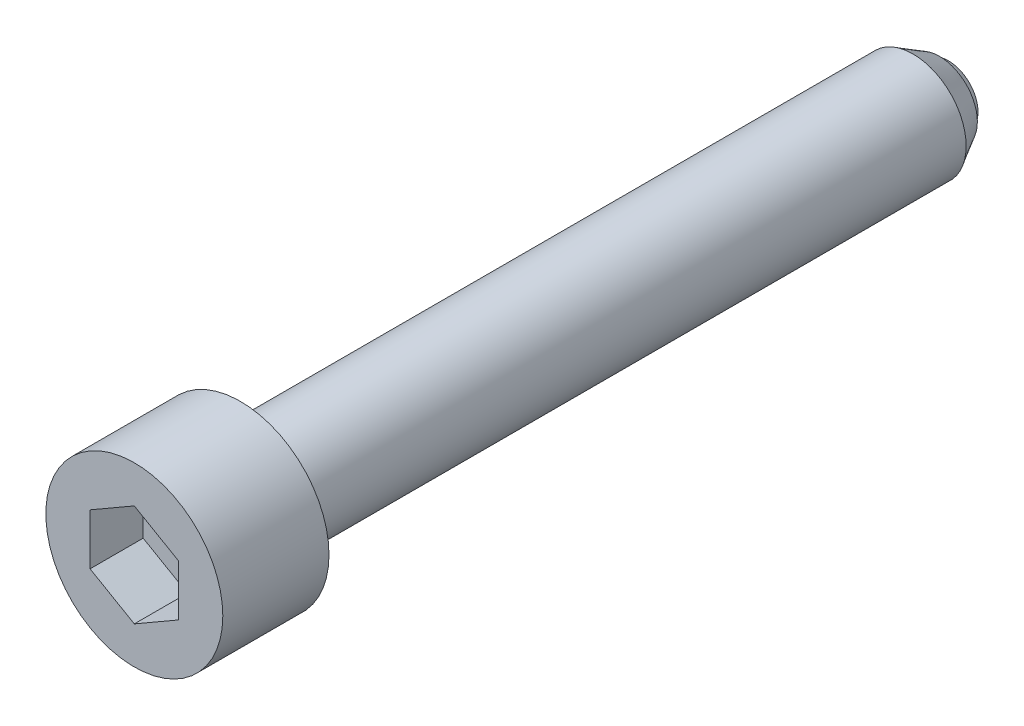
ISO-10303-21;
HEADER;
FILE_DESCRIPTION(('STEP AP214'),'2;1');
FILE_NAME('part.step','',(''),(''),'','','');
FILE_SCHEMA(('AUTOMOTIVE_DESIGN { 1 0 10303 214 1 1 1 1 }'));
ENDSEC;
DATA;
#1=APPLICATION_CONTEXT('core data for automotive mechanical design processes');
#2=APPLICATION_PROTOCOL_DEFINITION('international standard','automotive_design',2000,#1);
#3=PRODUCT_CONTEXT('',#1,'mechanical');
#4=PRODUCT('Part','Part','',(#3));
#5=PRODUCT_RELATED_PRODUCT_CATEGORY('part','',(#4));
#6=PRODUCT_DEFINITION_FORMATION('','',#4);
#7=PRODUCT_DEFINITION_CONTEXT('part definition',#1,'design');
#8=PRODUCT_DEFINITION('design','',#6,#7);
#9=PRODUCT_DEFINITION_SHAPE('','',#8);
#10=(LENGTH_UNIT() NAMED_UNIT(*) SI_UNIT(.MILLI.,.METRE.));
#11=(NAMED_UNIT(*) PLANE_ANGLE_UNIT() SI_UNIT($,.RADIAN.));
#12=(NAMED_UNIT(*) SI_UNIT($,.STERADIAN.) SOLID_ANGLE_UNIT());
#13=UNCERTAINTY_MEASURE_WITH_UNIT(LENGTH_MEASURE(1.E-05),#10,'distance_accuracy_value','');
#14=(GEOMETRIC_REPRESENTATION_CONTEXT(3) GLOBAL_UNCERTAINTY_ASSIGNED_CONTEXT((#13)) GLOBAL_UNIT_ASSIGNED_CONTEXT((#10,
#11,#12)) REPRESENTATION_CONTEXT('',''));
#15=CARTESIAN_POINT('',(0.,0.,0.));
#16=DIRECTION('',(0.,0.,1.));
#17=DIRECTION('',(1.,0.,0.));
#18=AXIS2_PLACEMENT_3D('',#15,#16,#17);
#19=CARTESIAN_POINT('',(0.,0.,1.1));
#20=DIRECTION('',(0.,0.,-1.));
#21=DIRECTION('',(1.,0.,0.));
#22=AXIS2_PLACEMENT_3D('',#19,#20,#21);
#23=SPHERICAL_SURFACE('',#22,2.);
#24=CARTESIAN_POINT('',(0.,0.,0.5));
#25=DIRECTION('',(0.,0.,-1.));
#26=DIRECTION('',(1.,0.,0.));
#27=AXIS2_PLACEMENT_3D('',#24,#25,#26);
#28=CIRCLE('',#27,1.90787840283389);
#29=CARTESIAN_POINT('',(1.90787840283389,0.,0.5));
#30=VERTEX_POINT('',#29);
#31=EDGE_CURVE('E9',#30,#30,#28,.T.);
#32=CARTESIAN_POINT('',(0.,0.,0.));
#33=DIRECTION('',(0.,0.,-1.));
#34=DIRECTION('',(1.,0.,0.));
#35=AXIS2_PLACEMENT_3D('',#32,#33,#34);
#36=CIRCLE('',#35,1.670329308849);
#37=CARTESIAN_POINT('',(1.67032930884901,0.,0.));
#38=VERTEX_POINT('',#37);
#39=EDGE_CURVE('E17',#38,#38,#36,.F.);
#40=CARTESIAN_POINT('',(1.90787840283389,0.,0.5));
#41=CARTESIAN_POINT('',(1.90614295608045,0.,0.494481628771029));
#42=CARTESIAN_POINT('',(1.90438356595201,0.,0.488970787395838));
#43=CARTESIAN_POINT('',(1.90081703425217,0.,0.477964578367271));
#44=CARTESIAN_POINT('',(1.89900989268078,0.,0.472469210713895));
#45=CARTESIAN_POINT('',(1.8953479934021,0.,0.46149436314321));
#46=CARTESIAN_POINT('',(1.89349323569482,0.,0.456014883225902));
#47=CARTESIAN_POINT('',(1.88973624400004,0.,0.445072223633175));
#48=CARTESIAN_POINT('',(1.88783401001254,0.,0.439609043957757));
#49=CARTESIAN_POINT('',(1.8839822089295,0.,0.428699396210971));
#50=CARTESIAN_POINT('',(1.88203264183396,0.,0.423252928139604));
#51=CARTESIAN_POINT('',(1.87808632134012,0.,0.412377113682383));
#52=CARTESIAN_POINT('',(1.87608956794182,0.,0.40694776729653));
#53=CARTESIAN_POINT('',(1.87204902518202,0.,0.396106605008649));
#54=CARTESIAN_POINT('',(1.87000523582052,0.,0.39069478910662));
#55=CARTESIAN_POINT('',(1.86587077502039,0.,0.379889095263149));
#56=CARTESIAN_POINT('',(1.86378010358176,0.,0.374495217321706));
#57=CARTESIAN_POINT('',(1.85955203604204,0.,0.363725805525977));
#58=CARTESIAN_POINT('',(1.85741463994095,0.,0.358350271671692));
#59=CARTESIAN_POINT('',(1.85309328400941,0.,0.347617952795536));
#60=CARTESIAN_POINT('',(1.85090932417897,0.,0.342261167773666));
#61=CARTESIAN_POINT('',(1.84649500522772,0.,0.331566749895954));
#62=CARTESIAN_POINT('',(1.84426464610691,0.,0.326229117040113));
#63=CARTESIAN_POINT('',(1.83975769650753,0.,0.315573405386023));
#64=CARTESIAN_POINT('',(1.83748110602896,0.,0.310255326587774));
#65=CARTESIAN_POINT('',(1.83288186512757,0.,0.299639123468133));
#66=CARTESIAN_POINT('',(1.83055921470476,0.,0.29434099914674));
#67=CARTESIAN_POINT('',(1.82586802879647,0.,0.283765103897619));
#68=CARTESIAN_POINT('',(1.823499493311,0.,0.278487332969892));
#69=CARTESIAN_POINT('',(1.81871671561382,0.,0.267952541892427));
#70=CARTESIAN_POINT('',(1.81630247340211,0.,0.26269552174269));
#71=CARTESIAN_POINT('',(1.81142846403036,0.,0.252202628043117));
#72=CARTESIAN_POINT('',(1.80896869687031,0.,0.246966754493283));
#73=CARTESIAN_POINT('',(1.80400382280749,0.,0.236516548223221));
#74=CARTESIAN_POINT('',(1.80149871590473,0.,0.231302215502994));
#75=CARTESIAN_POINT('',(1.79644335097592,0.,0.220895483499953));
#76=CARTESIAN_POINT('',(1.79389309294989,0.,0.215703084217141));
#77=CARTESIAN_POINT('',(1.78874761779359,0.,0.205340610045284));
#78=CARTESIAN_POINT('',(1.78615240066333,0.,0.200170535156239));
#79=CARTESIAN_POINT('',(1.78091720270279,0.,0.189853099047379));
#80=CARTESIAN_POINT('',(1.77827722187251,0.,0.184705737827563));
#81=CARTESIAN_POINT('',(1.77295269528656,0.,0.174434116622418));
#82=CARTESIAN_POINT('',(1.77026814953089,0.,0.169309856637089));
#83=CARTESIAN_POINT('',(1.76485469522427,0.,0.159084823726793));
#84=CARTESIAN_POINT('',(1.76212578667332,0.,0.153984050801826));
#85=CARTESIAN_POINT('',(1.7566238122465,0.,0.143806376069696));
#86=CARTESIAN_POINT('',(1.75385074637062,0.,0.138729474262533));
#87=CARTESIAN_POINT('',(1.7482606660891,0.,0.128599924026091));
#88=CARTESIAN_POINT('',(1.74544365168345,0.,0.123547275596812));
#89=CARTESIAN_POINT('',(1.73976588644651,0.,0.113466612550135));
#90=CARTESIAN_POINT('',(1.73690513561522,0.,0.108438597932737));
#91=CARTESIAN_POINT('',(1.73114011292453,0.,0.0984075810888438));
#92=CARTESIAN_POINT('',(1.72823584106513,0.,0.0934045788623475));
#93=CARTESIAN_POINT('',(1.72238399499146,0.,0.0834239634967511));
#94=CARTESIAN_POINT('',(1.71943642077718,0.,0.078446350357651));
#95=CARTESIAN_POINT('',(1.71349819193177,0.,0.0685168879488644));
#96=CARTESIAN_POINT('',(1.71050753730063,0.,0.0635650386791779));
#97=CARTESIAN_POINT('',(1.70448337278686,0.,0.0536874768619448));
#98=CARTESIAN_POINT('',(1.70144986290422,0.,0.0487617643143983));
#99=CARTESIAN_POINT('',(1.6953402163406,0.,0.0389368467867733));
#100=CARTESIAN_POINT('',(1.69226407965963,0.,0.034037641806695));
#101=CARTESIAN_POINT('',(1.68606941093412,0.,0.0242661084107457));
#102=CARTESIAN_POINT('',(1.68295087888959,0.,0.0193937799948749));
#103=CARTESIAN_POINT('',(1.67667165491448,0.,0.00967636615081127));
#104=CARTESIAN_POINT('',(1.67351096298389,0.,0.00483128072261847));
#105=CARTESIAN_POINT('',(1.67032930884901,0.,0.));
#106=B_SPLINE_CURVE_WITH_KNOTS('',3,(#40,#41,#42,#43,#44,#45,#46,#47,#48,#49,#50,#51,#52,#53,
#54,#55,#56,#57,#58,#59,#60,#61,#62,#63,#64,#65,#66,#67,#68,#69,#70,#71,#72,#73,#74,#75,#76,#77,
#78,#79,#80,#81,#82,#83,#84,#85,#86,#87,#88,#89,#90,#91,#92,#93,#94,#95,#96,#97,#98,#99,#100,
#101,#102,#103,#104,#105),.UNSPECIFIED.,.F.,.F.,(4,2,2,2,2,2,2,2,2,2,2,2,2,2,2,2,2,2,2,2,2,2,2,
2,2,2,2,2,2,2,2,2,4),(0.,0.0173544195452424,0.0347088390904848,0.0520632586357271,
0.0694176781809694,0.0867720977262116,0.104126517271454,0.121480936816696,0.138835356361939,
0.156189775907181,0.173544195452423,0.190898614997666,0.208253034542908,0.22560745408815,
0.242961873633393,0.260316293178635,0.277670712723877,0.295025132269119,0.312379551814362,
0.329733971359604,0.347088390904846,0.364442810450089,0.381797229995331,0.399151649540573,
0.416506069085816,0.433860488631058,0.4512149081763,0.468569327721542,0.485923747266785,
0.503278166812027,0.52063258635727,0.537987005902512,0.555341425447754),.UNSPECIFIED.);
#107=EDGE_CURVE('BSEAM14',#30,#38,#106,.T.);
#108=ORIENTED_EDGE('',*,*,#31,.T.);
#109=ORIENTED_EDGE('',*,*,#39,.T.);
#110=ORIENTED_EDGE('',*,*,#107,.T.);
#111=ORIENTED_EDGE('',*,*,#107,.F.);
#112=EDGE_LOOP('',(#108,#110,#109,#111));
#113=FACE_BOUND('',#112,.T.);
#114=ADVANCED_FACE('F14',(#113),#23,.T.);
#115=CARTESIAN_POINT('',(2.13397459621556,0.,0.5));
#116=DIRECTION('',(0.,0.,1.));
#117=DIRECTION('',(-1.,0.,0.));
#118=AXIS2_PLACEMENT_3D('',#115,#116,#117);
#119=PLANE('',#118);
#120=ORIENTED_EDGE('',*,*,#31,.F.);
#121=EDGE_LOOP('',(#120));
#122=FACE_BOUND('',#121,.T.);
#123=CARTESIAN_POINT('',(0.,0.,0.5));
#124=DIRECTION('',(0.,0.,-1.));
#125=DIRECTION('',(1.,0.,0.));
#126=AXIS2_PLACEMENT_3D('',#123,#124,#125);
#127=CIRCLE('',#126,2.13397459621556);
#128=CARTESIAN_POINT('',(2.13397459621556,0.,0.5));
#129=VERTEX_POINT('',#128);
#130=EDGE_CURVE('E22',#129,#129,#127,.T.);
#131=ORIENTED_EDGE('',*,*,#130,.T.);
#132=EDGE_LOOP('',(#131));
#133=FACE_BOUND('',#132,.T.);
#134=ADVANCED_FACE('F137',(#122,#133),#119,.F.);
#135=CARTESIAN_POINT('',(0.,0.,2.));
#136=DIRECTION('',(0.,0.,1.));
#137=DIRECTION('',(-1.,0.,0.));
#138=AXIS2_PLACEMENT_3D('',#135,#136,#137);
#139=CONICAL_SURFACE('',#138,3.,0.523598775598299);
#140=ORIENTED_EDGE('',*,*,#130,.F.);
#141=EDGE_LOOP('',(#140));
#142=FACE_BOUND('',#141,.T.);
#143=CARTESIAN_POINT('',(0.,0.,2.));
#144=DIRECTION('',(0.,0.,-1.));
#145=DIRECTION('',(1.,0.,0.));
#146=AXIS2_PLACEMENT_3D('',#143,#144,#145);
#147=CIRCLE('',#146,3.);
#148=CARTESIAN_POINT('',(3.,0.,2.));
#149=VERTEX_POINT('',#148);
#150=EDGE_CURVE('E131',#149,#149,#147,.T.);
#151=ORIENTED_EDGE('',*,*,#150,.T.);
#152=EDGE_LOOP('',(#151));
#153=FACE_BOUND('',#152,.T.);
#154=ADVANCED_FACE('F139',(#142,#153),#139,.T.);
#155=CARTESIAN_POINT('',(0.,0.,20.));
#156=DIRECTION('',(0.,0.,-1.));
#157=DIRECTION('',(1.,0.,0.));
#158=AXIS2_PLACEMENT_3D('',#155,#156,#157);
#159=CYLINDRICAL_SURFACE('',#158,3.);
#160=ORIENTED_EDGE('',*,*,#150,.F.);
#161=EDGE_LOOP('',(#160));
#162=FACE_BOUND('',#161,.T.);
#163=CARTESIAN_POINT('',(0.,0.,40.));
#164=DIRECTION('',(0.,0.,-1.));
#165=DIRECTION('',(1.,0.,0.));
#166=AXIS2_PLACEMENT_3D('',#163,#164,#165);
#167=CIRCLE('',#166,3.);
#168=CARTESIAN_POINT('',(3.,0.,40.));
#169=VERTEX_POINT('',#168);
#170=EDGE_CURVE('E128',#169,#169,#167,.T.);
#171=ORIENTED_EDGE('',*,*,#170,.T.);
#172=EDGE_LOOP('',(#171));
#173=FACE_BOUND('',#172,.T.);
#174=ADVANCED_FACE('F142',(#162,#173),#159,.T.);
#175=CARTESIAN_POINT('',(3.,0.,40.));
#176=DIRECTION('',(0.,0.,-1.));
#177=DIRECTION('',(1.,0.,0.));
#178=AXIS2_PLACEMENT_3D('',#175,#176,#177);
#179=PLANE('',#178);
#180=CARTESIAN_POINT('',(0.,0.,40.));
#181=DIRECTION('',(0.,0.,-1.));
#182=DIRECTION('',(1.,0.,0.));
#183=AXIS2_PLACEMENT_3D('',#180,#181,#182);
#184=CIRCLE('',#183,5.);
#185=CARTESIAN_POINT('',(5.,0.,40.));
#186=VERTEX_POINT('',#185);
#187=EDGE_CURVE('E125',#186,#186,#184,.T.);
#188=ORIENTED_EDGE('',*,*,#187,.T.);
#189=EDGE_LOOP('',(#188));
#190=FACE_BOUND('',#189,.T.);
#191=ORIENTED_EDGE('',*,*,#170,.F.);
#192=EDGE_LOOP('',(#191));
#193=FACE_BOUND('',#192,.T.);
#194=ADVANCED_FACE('F148',(#190,#193),#179,.T.);
#195=CARTESIAN_POINT('',(0.,0.,20.));
#196=DIRECTION('',(0.,0.,-1.));
#197=DIRECTION('',(1.,0.,0.));
#198=AXIS2_PLACEMENT_3D('',#195,#196,#197);
#199=CYLINDRICAL_SURFACE('',#198,5.);
#200=CARTESIAN_POINT('',(0.,0.,46.));
#201=DIRECTION('',(0.,0.,-1.));
#202=DIRECTION('',(1.,0.,0.));
#203=AXIS2_PLACEMENT_3D('',#200,#201,#202);
#204=CIRCLE('',#203,5.);
#205=CARTESIAN_POINT('',(5.,0.,46.));
#206=VERTEX_POINT('',#205);
#207=EDGE_CURVE('E122',#206,#206,#204,.T.);
#208=ORIENTED_EDGE('',*,*,#207,.T.);
#209=EDGE_LOOP('',(#208));
#210=FACE_BOUND('',#209,.T.);
#211=ORIENTED_EDGE('',*,*,#187,.F.);
#212=EDGE_LOOP('',(#211));
#213=FACE_BOUND('',#212,.T.);
#214=ADVANCED_FACE('F153',(#210,#213),#199,.T.);
#215=CARTESIAN_POINT('',(5.,0.,46.));
#216=DIRECTION('',(0.,0.,1.));
#217=DIRECTION('',(-1.,0.,0.));
#218=AXIS2_PLACEMENT_3D('',#215,#216,#217);
#219=PLANE('',#218);
#220=DIRECTION('',(-0.86602540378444,0.5,0.));
#221=VECTOR('',#220,1.);
#222=CARTESIAN_POINT('',(2.5,1.44337567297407,46.));
#223=LINE('',#222,#221);
#224=CARTESIAN_POINT('',(2.5,1.44337567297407,46.));
#225=VERTEX_POINT('',#224);
#226=CARTESIAN_POINT('',(0.,2.88675134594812,46.));
#227=VERTEX_POINT('',#226);
#228=EDGE_CURVE('E29',#225,#227,#223,.T.);
#229=ORIENTED_EDGE('',*,*,#228,.F.);
#230=DIRECTION('',(0.,1.,0.));
#231=VECTOR('',#230,1.);
#232=CARTESIAN_POINT('',(2.5,-1.44337567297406,46.));
#233=LINE('',#232,#231);
#234=CARTESIAN_POINT('',(2.5,-1.44337567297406,46.));
#235=VERTEX_POINT('',#234);
#236=EDGE_CURVE('E98',#235,#225,#233,.T.);
#237=ORIENTED_EDGE('',*,*,#236,.F.);
#238=DIRECTION('',(-0.866025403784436,-0.5,0.));
#239=VECTOR('',#238,1.);
#240=CARTESIAN_POINT('',(2.5,-1.44337567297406,46.));
#241=LINE('',#240,#239);
#242=CARTESIAN_POINT('',(0.,-2.88675134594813,46.));
#243=VERTEX_POINT('',#242);
#244=EDGE_CURVE('E93',#235,#243,#241,.T.);
#245=ORIENTED_EDGE('',*,*,#244,.T.);
#246=DIRECTION('',(0.866025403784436,-0.5,0.));
#247=VECTOR('',#246,1.);
#248=CARTESIAN_POINT('',(-2.5,-1.44337567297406,46.));
#249=LINE('',#248,#247);
#250=CARTESIAN_POINT('',(-2.5,-1.44337567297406,46.));
#251=VERTEX_POINT('',#250);
#252=EDGE_CURVE('E91',#251,#243,#249,.T.);
#253=ORIENTED_EDGE('',*,*,#252,.F.);
#254=DIRECTION('',(0.,1.,0.));
#255=VECTOR('',#254,1.);
#256=CARTESIAN_POINT('',(-2.5,-1.44337567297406,46.));
#257=LINE('',#256,#255);
#258=CARTESIAN_POINT('',(-2.5,1.44337567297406,46.));
#259=VERTEX_POINT('',#258);
#260=EDGE_CURVE('E72',#251,#259,#257,.T.);
#261=ORIENTED_EDGE('',*,*,#260,.T.);
#262=DIRECTION('',(0.866025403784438,0.5,0.));
#263=VECTOR('',#262,1.);
#264=CARTESIAN_POINT('',(-2.5,1.44337567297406,46.));
#265=LINE('',#264,#263);
#266=EDGE_CURVE('E83',#259,#227,#265,.T.);
#267=ORIENTED_EDGE('',*,*,#266,.T.);
#268=EDGE_LOOP('',(#229,#237,#245,#253,#261,#267));
#269=FACE_BOUND('',#268,.T.);
#270=ORIENTED_EDGE('',*,*,#207,.F.);
#271=EDGE_LOOP('',(#270));
#272=FACE_BOUND('',#271,.T.);
#273=ADVANCED_FACE('F87',(#269,#272),#219,.T.);
#274=CARTESIAN_POINT('',(2.5,1.44337567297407,43.));
#275=DIRECTION('',(0.5,0.86602540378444,0.));
#276=DIRECTION('',(0.86602540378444,-0.5,0.));
#277=AXIS2_PLACEMENT_3D('',#274,#275,#276);
#278=PLANE('',#277);
#279=DIRECTION('',(0.,0.,1.));
#280=VECTOR('',#279,1.);
#281=CARTESIAN_POINT('',(2.5,1.44337567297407,43.));
#282=LINE('',#281,#280);
#283=CARTESIAN_POINT('',(2.5,1.44337567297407,43.));
#284=VERTEX_POINT('',#283);
#285=EDGE_CURVE('E36',#284,#225,#282,.T.);
#286=ORIENTED_EDGE('',*,*,#285,.T.);
#287=ORIENTED_EDGE('',*,*,#228,.T.);
#288=DIRECTION('',(0.,0.,1.));
#289=VECTOR('',#288,1.);
#290=CARTESIAN_POINT('',(0.,2.88675134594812,43.));
#291=LINE('',#290,#289);
#292=CARTESIAN_POINT('',(0.,2.88675134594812,43.));
#293=VERTEX_POINT('',#292);
#294=EDGE_CURVE('E80',#293,#227,#291,.T.);
#295=ORIENTED_EDGE('',*,*,#294,.F.);
#296=DIRECTION('',(-0.86602540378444,0.5,0.));
#297=VECTOR('',#296,1.);
#298=CARTESIAN_POINT('',(2.5,1.44337567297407,43.));
#299=LINE('',#298,#297);
#300=EDGE_CURVE('E100',#284,#293,#299,.T.);
#301=ORIENTED_EDGE('',*,*,#300,.F.);
#302=EDGE_LOOP('',(#286,#287,#295,#301));
#303=FACE_BOUND('',#302,.T.);
#304=ADVANCED_FACE('F190',(#303),#278,.F.);
#305=CARTESIAN_POINT('',(2.5,-1.44337567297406,43.));
#306=DIRECTION('',(1.,0.,0.));
#307=DIRECTION('',(0.,0.,1.));
#308=AXIS2_PLACEMENT_3D('',#305,#306,#307);
#309=PLANE('',#308);
#310=DIRECTION('',(0.,0.,1.));
#311=VECTOR('',#310,1.);
#312=CARTESIAN_POINT('',(2.5,-1.44337567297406,43.));
#313=LINE('',#312,#311);
#314=CARTESIAN_POINT('',(2.5,-1.44337567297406,43.));
#315=VERTEX_POINT('',#314);
#316=EDGE_CURVE('E119',#315,#235,#313,.T.);
#317=ORIENTED_EDGE('',*,*,#316,.T.);
#318=ORIENTED_EDGE('',*,*,#236,.T.);
#319=ORIENTED_EDGE('',*,*,#285,.F.);
#320=DIRECTION('',(0.,1.,0.));
#321=VECTOR('',#320,1.);
#322=CARTESIAN_POINT('',(2.5,-1.44337567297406,43.));
#323=LINE('',#322,#321);
#324=EDGE_CURVE('E112',#315,#284,#323,.T.);
#325=ORIENTED_EDGE('',*,*,#324,.F.);
#326=EDGE_LOOP('',(#317,#318,#319,#325));
#327=FACE_BOUND('',#326,.T.);
#328=ADVANCED_FACE('F198',(#327),#309,.F.);
#329=CARTESIAN_POINT('',(2.5,-1.44337567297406,43.));
#330=DIRECTION('',(-0.5,0.866025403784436,0.));
#331=DIRECTION('',(0.866025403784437,0.5,0.));
#332=AXIS2_PLACEMENT_3D('',#329,#330,#331);
#333=PLANE('',#332);
#334=DIRECTION('',(0.,0.,1.));
#335=VECTOR('',#334,1.);
#336=CARTESIAN_POINT('',(0.,-2.88675134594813,43.));
#337=LINE('',#336,#335);
#338=CARTESIAN_POINT('',(0.,-2.88675134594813,43.));
#339=VERTEX_POINT('',#338);
#340=EDGE_CURVE('E117',#339,#243,#337,.T.);
#341=ORIENTED_EDGE('',*,*,#340,.T.);
#342=ORIENTED_EDGE('',*,*,#244,.F.);
#343=ORIENTED_EDGE('',*,*,#316,.F.);
#344=DIRECTION('',(-0.866025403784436,-0.5,0.));
#345=VECTOR('',#344,1.);
#346=CARTESIAN_POINT('',(2.5,-1.44337567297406,43.));
#347=LINE('',#346,#345);
#348=EDGE_CURVE('E109',#315,#339,#347,.T.);
#349=ORIENTED_EDGE('',*,*,#348,.T.);
#350=EDGE_LOOP('',(#341,#342,#343,#349));
#351=FACE_BOUND('',#350,.T.);
#352=ADVANCED_FACE('F194',(#351),#333,.T.);
#353=CARTESIAN_POINT('',(-2.5,-1.44337567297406,43.));
#354=DIRECTION('',(-0.5,-0.866025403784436,0.));
#355=DIRECTION('',(-0.866025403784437,0.5,0.));
#356=AXIS2_PLACEMENT_3D('',#353,#354,#355);
#357=PLANE('',#356);
#358=DIRECTION('',(0.,0.,1.));
#359=VECTOR('',#358,1.);
#360=CARTESIAN_POINT('',(-2.5,-1.44337567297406,43.));
#361=LINE('',#360,#359);
#362=CARTESIAN_POINT('',(-2.5,-1.44337567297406,43.));
#363=VERTEX_POINT('',#362);
#364=EDGE_CURVE('E79',#363,#251,#361,.T.);
#365=ORIENTED_EDGE('',*,*,#364,.T.);
#366=ORIENTED_EDGE('',*,*,#252,.T.);
#367=ORIENTED_EDGE('',*,*,#340,.F.);
#368=DIRECTION('',(0.866025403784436,-0.5,0.));
#369=VECTOR('',#368,1.);
#370=CARTESIAN_POINT('',(-2.5,-1.44337567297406,43.));
#371=LINE('',#370,#369);
#372=EDGE_CURVE('E106',#363,#339,#371,.T.);
#373=ORIENTED_EDGE('',*,*,#372,.F.);
#374=EDGE_LOOP('',(#365,#366,#367,#373));
#375=FACE_BOUND('',#374,.T.);
#376=ADVANCED_FACE('F187',(#375),#357,.F.);
#377=CARTESIAN_POINT('',(-2.5,-1.44337567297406,43.));
#378=DIRECTION('',(1.,0.,0.));
#379=DIRECTION('',(0.,-1.,0.));
#380=AXIS2_PLACEMENT_3D('',#377,#378,#379);
#381=PLANE('',#380);
#382=DIRECTION('',(0.,0.,1.));
#383=VECTOR('',#382,1.);
#384=CARTESIAN_POINT('',(-2.5,1.44337567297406,43.));
#385=LINE('',#384,#383);
#386=CARTESIAN_POINT('',(-2.5,1.44337567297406,43.));
#387=VERTEX_POINT('',#386);
#388=EDGE_CURVE('E68',#387,#259,#385,.T.);
#389=ORIENTED_EDGE('',*,*,#388,.T.);
#390=ORIENTED_EDGE('',*,*,#260,.F.);
#391=ORIENTED_EDGE('',*,*,#364,.F.);
#392=DIRECTION('',(0.,1.,0.));
#393=VECTOR('',#392,1.);
#394=CARTESIAN_POINT('',(-2.5,-1.44337567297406,43.));
#395=LINE('',#394,#393);
#396=EDGE_CURVE('E75',#363,#387,#395,.T.);
#397=ORIENTED_EDGE('',*,*,#396,.T.);
#398=EDGE_LOOP('',(#389,#390,#391,#397));
#399=FACE_BOUND('',#398,.T.);
#400=ADVANCED_FACE('F70',(#399),#381,.T.);
#401=CARTESIAN_POINT('',(-2.5,1.44337567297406,43.));
#402=DIRECTION('',(0.5,-0.866025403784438,0.));
#403=DIRECTION('',(-0.866025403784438,-0.5,0.));
#404=AXIS2_PLACEMENT_3D('',#401,#402,#403);
#405=PLANE('',#404);
#406=DIRECTION('',(0.866025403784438,0.5,0.));
#407=VECTOR('',#406,1.);
#408=CARTESIAN_POINT('',(-2.5,1.44337567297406,43.));
#409=LINE('',#408,#407);
#410=EDGE_CURVE('E103',#387,#293,#409,.T.);
#411=ORIENTED_EDGE('',*,*,#410,.T.);
#412=ORIENTED_EDGE('',*,*,#294,.T.);
#413=ORIENTED_EDGE('',*,*,#266,.F.);
#414=ORIENTED_EDGE('',*,*,#388,.F.);
#415=EDGE_LOOP('',(#411,#412,#413,#414));
#416=FACE_BOUND('',#415,.T.);
#417=ADVANCED_FACE('F84',(#416),#405,.T.);
#418=CARTESIAN_POINT('',(2.5,1.44337567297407,43.));
#419=DIRECTION('',(0.,0.,-1.));
#420=DIRECTION('',(1.,0.,0.));
#421=AXIS2_PLACEMENT_3D('',#418,#419,#420);
#422=PLANE('',#421);
#423=ORIENTED_EDGE('',*,*,#300,.T.);
#424=ORIENTED_EDGE('',*,*,#410,.F.);
#425=ORIENTED_EDGE('',*,*,#396,.F.);
#426=ORIENTED_EDGE('',*,*,#372,.T.);
#427=ORIENTED_EDGE('',*,*,#348,.F.);
#428=ORIENTED_EDGE('',*,*,#324,.T.);
#429=EDGE_LOOP('',(#423,#424,#425,#426,#427,#428));
#430=FACE_BOUND('',#429,.T.);
#431=ADVANCED_FACE('F175',(#430),#422,.F.);
#432=CARTESIAN_POINT('',(0.,0.,0.));
#433=DIRECTION('',(0.,0.,-1.));
#434=DIRECTION('',(1.,0.,0.));
#435=AXIS2_PLACEMENT_3D('',#432,#433,#434);
#436=PLANE('',#435);
#437=ORIENTED_EDGE('',*,*,#39,.F.);
#438=EDGE_LOOP('',(#437));
#439=FACE_BOUND('',#438,.T.);
#440=ADVANCED_FACE('F173',(#439),#436,.T.);
#441=CLOSED_SHELL('',(#114,#134,#154,#174,#194,#214,#273,#304,#328,#352,#376,#400,#417,#431,#440));
#442=MANIFOLD_SOLID_BREP('B1',#441);
#443=ADVANCED_BREP_SHAPE_REPRESENTATION('',(#18,#442),#14);
#444=SHAPE_DEFINITION_REPRESENTATION(#9,#443);
ENDSEC;
END-ISO-10303-21;
